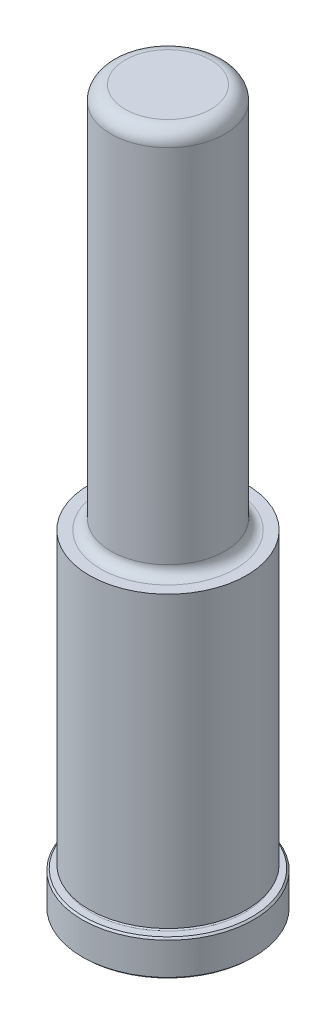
from build123d import *

# Parameters (mm, degrees)
CHAMFER1_SIZE = 0.381
FILLET7_R     = 3.175


with BuildPart() as part:
    # Sketch1 → Revolve1 (revolve)
    with BuildSketch(Plane(origin=(0, 0, 0), x_dir=(0, 0, -1), z_dir=(1, 0, 0)), mode=Mode.PRIVATE) as revolve1_sk:
        with BuildLine():
            Line((0, 0), (19.05, 0))
            Line((19.05, 0), (19.05, 7.9248))
            Line((19.05, 7.9248), (17.0688, 7.9248))
            ThreePointArc((17.0688, 7.9248), (16.6878, 8.3058), (17.0688, 8.6868))
            Line((17.0688, 8.6868), (17.4752, 8.6868))
            Line((17.4752, 8.6868), (17.4752, 73.025))
            Line((17.4752, 73.025), (14.9733, 73.025))
            ThreePointArc((14.9733, 73.025), (13.356853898, 73.694553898), (12.6873, 75.311))
            Line((12.6873, 75.311), (12.6873, 158.75))
            Line((12.6873, 158.75), (0, 158.75))
            Line((0, 158.75), (0, 0))
        make_face()
    revolve(revolve1_sk.sketch.rotate(Axis((0, 0, 0), (0, -1, 0)), 180), axis=Axis((0, 0, 0), (0, -1, 0)))

    # Chamfer1
    chamfer1_edges = [part.edges().sort_by_distance(p)[0] for p in [
        (0, 7.9248, -19.05),
        (0, 0, -19.05),
    ]]
    chamfer(chamfer1_edges, length=CHAMFER1_SIZE)

    # Fillet7
    fillet7_edges = [part.edges().sort_by_distance(p)[0] for p in [
        (0, 158.75, -12.6873),
    ]]
    fillet(fillet7_edges, radius=FILLET7_R)


solid = part.part
